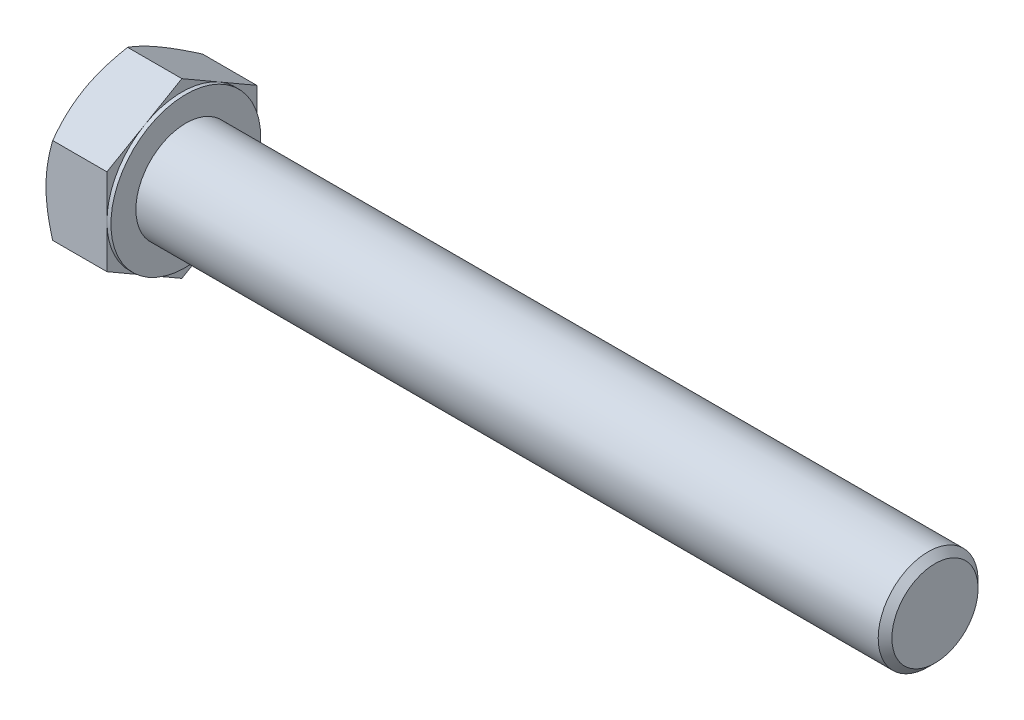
ISO-10303-21;
HEADER;
FILE_DESCRIPTION(('STEP AP214'),'2;1');
FILE_NAME('part.step','',(''),(''),'','','');
FILE_SCHEMA(('AUTOMOTIVE_DESIGN { 1 0 10303 214 1 1 1 1 }'));
ENDSEC;
DATA;
#1=APPLICATION_CONTEXT('core data for automotive mechanical design processes');
#2=APPLICATION_PROTOCOL_DEFINITION('international standard','automotive_design',2000,#1);
#3=PRODUCT_CONTEXT('',#1,'mechanical');
#4=PRODUCT('Part','Part','',(#3));
#5=PRODUCT_RELATED_PRODUCT_CATEGORY('part','',(#4));
#6=PRODUCT_DEFINITION_FORMATION('','',#4);
#7=PRODUCT_DEFINITION_CONTEXT('part definition',#1,'design');
#8=PRODUCT_DEFINITION('design','',#6,#7);
#9=PRODUCT_DEFINITION_SHAPE('','',#8);
#10=(LENGTH_UNIT() NAMED_UNIT(*) SI_UNIT(.MILLI.,.METRE.));
#11=(NAMED_UNIT(*) PLANE_ANGLE_UNIT() SI_UNIT($,.RADIAN.));
#12=(NAMED_UNIT(*) SI_UNIT($,.STERADIAN.) SOLID_ANGLE_UNIT());
#13=UNCERTAINTY_MEASURE_WITH_UNIT(LENGTH_MEASURE(1.E-05),#10,'distance_accuracy_value','');
#14=(GEOMETRIC_REPRESENTATION_CONTEXT(3) GLOBAL_UNCERTAINTY_ASSIGNED_CONTEXT((#13)) GLOBAL_UNIT_ASSIGNED_CONTEXT((#10,
#11,#12)) REPRESENTATION_CONTEXT('',''));
#15=CARTESIAN_POINT('',(0.,0.,0.));
#16=DIRECTION('',(0.,0.,1.));
#17=DIRECTION('',(1.,0.,0.));
#18=AXIS2_PLACEMENT_3D('',#15,#16,#17);
#19=CARTESIAN_POINT('',(13.,17.3205080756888,0.));
#20=DIRECTION('',(1.,0.,0.));
#21=DIRECTION('',(0.,0.,-1.));
#22=AXIS2_PLACEMENT_3D('',#19,#20,#21);
#23=PLANE('',#22);
#24=CARTESIAN_POINT('',(13.,0.,0.));
#25=DIRECTION('',(1.,0.,0.));
#26=DIRECTION('',(0.,0.,-1.));
#27=AXIS2_PLACEMENT_3D('',#24,#25,#26);
#28=CIRCLE('',#27,10.);
#29=CARTESIAN_POINT('',(13.,0.,-10.));
#30=VERTEX_POINT('',#29);
#31=EDGE_CURVE('E269',#30,#30,#28,.F.);
#32=ORIENTED_EDGE('',*,*,#31,.T.);
#33=EDGE_LOOP('',(#32));
#34=FACE_BOUND('',#33,.T.);
#35=CARTESIAN_POINT('',(13.,0.,0.));
#36=DIRECTION('',(1.,0.,0.));
#37=DIRECTION('',(0.,0.,-1.));
#38=AXIS2_PLACEMENT_3D('',#35,#36,#37);
#39=CIRCLE('',#38,15.);
#40=CARTESIAN_POINT('',(13.,0.,-15.));
#41=VERTEX_POINT('',#40);
#42=EDGE_CURVE('E327',#41,#41,#39,.T.);
#43=ORIENTED_EDGE('',*,*,#42,.T.);
#44=EDGE_LOOP('',(#43));
#45=FACE_BOUND('',#44,.T.);
#46=ADVANCED_FACE('F33',(#34,#45),#23,.T.);
#47=CARTESIAN_POINT('',(0.,0.,0.));
#48=DIRECTION('',(-1.,0.,0.));
#49=DIRECTION('',(0.,0.,1.));
#50=AXIS2_PLACEMENT_3D('',#47,#48,#49);
#51=CYLINDRICAL_SURFACE('',#50,10.);
#52=ORIENTED_EDGE('',*,*,#31,.F.);
#53=EDGE_LOOP('',(#52));
#54=FACE_BOUND('',#53,.T.);
#55=CARTESIAN_POINT('',(161.626,0.,0.));
#56=DIRECTION('',(-1.,0.,0.));
#57=DIRECTION('',(0.,0.,1.));
#58=AXIS2_PLACEMENT_3D('',#55,#56,#57);
#59=CIRCLE('',#58,10.);
#60=CARTESIAN_POINT('',(161.626,0.,10.));
#61=VERTEX_POINT('',#60);
#62=EDGE_CURVE('E267',#61,#61,#59,.T.);
#63=ORIENTED_EDGE('',*,*,#62,.T.);
#64=EDGE_LOOP('',(#63));
#65=FACE_BOUND('',#64,.T.);
#66=ADVANCED_FACE('F242',(#54,#65),#51,.T.);
#67=CARTESIAN_POINT('',(163.,0.,0.));
#68=DIRECTION('',(-1.,0.,0.));
#69=DIRECTION('',(0.,0.,1.));
#70=AXIS2_PLACEMENT_3D('',#67,#68,#69);
#71=CONICAL_SURFACE('',#70,8.626,0.785398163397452);
#72=ORIENTED_EDGE('',*,*,#62,.F.);
#73=EDGE_LOOP('',(#72));
#74=FACE_BOUND('',#73,.T.);
#75=CARTESIAN_POINT('',(163.,0.,0.));
#76=DIRECTION('',(-1.,0.,0.));
#77=DIRECTION('',(0.,0.,1.));
#78=AXIS2_PLACEMENT_3D('',#75,#76,#77);
#79=CIRCLE('',#78,8.626);
#80=CARTESIAN_POINT('',(163.,0.,8.626));
#81=VERTEX_POINT('',#80);
#82=EDGE_CURVE('E229',#81,#81,#79,.T.);
#83=ORIENTED_EDGE('',*,*,#82,.T.);
#84=EDGE_LOOP('',(#83));
#85=FACE_BOUND('',#84,.T.);
#86=ADVANCED_FACE('F247',(#74,#85),#71,.T.);
#87=CARTESIAN_POINT('',(163.,0.,0.));
#88=DIRECTION('',(-1.,0.,0.));
#89=DIRECTION('',(0.,0.,1.));
#90=AXIS2_PLACEMENT_3D('',#87,#88,#89);
#91=PLANE('',#90);
#92=ORIENTED_EDGE('',*,*,#82,.F.);
#93=EDGE_LOOP('',(#92));
#94=FACE_BOUND('',#93,.T.);
#95=ADVANCED_FACE('F254',(#94),#91,.F.);
#96=CARTESIAN_POINT('',(12.2,15.,0.));
#97=DIRECTION('',(1.,0.,0.));
#98=DIRECTION('',(0.,0.,-1.));
#99=AXIS2_PLACEMENT_3D('',#96,#97,#98);
#100=PLANE('',#99);
#101=DIRECTION('',(0.,0.500000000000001,0.866025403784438));
#102=VECTOR('',#101,1.);
#103=CARTESIAN_POINT('',(12.2,8.66025403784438,-15.));
#104=LINE('',#103,#102);
#105=CARTESIAN_POINT('',(12.2,8.66025403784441,-15.));
#106=VERTEX_POINT('',#105);
#107=CARTESIAN_POINT('',(12.2,12.9903810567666,-7.50000000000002));
#108=VERTEX_POINT('',#107);
#109=EDGE_CURVE('E166',#106,#108,#104,.T.);
#110=ORIENTED_EDGE('',*,*,#109,.T.);
#111=CARTESIAN_POINT('',(12.2,0.,0.));
#112=DIRECTION('',(-1.,0.,0.));
#113=DIRECTION('',(0.,0.,1.));
#114=AXIS2_PLACEMENT_3D('',#111,#112,#113);
#115=CIRCLE('',#114,15.);
#116=CARTESIAN_POINT('',(12.2,0.,-15.));
#117=VERTEX_POINT('',#116);
#118=EDGE_CURVE('E49',#108,#117,#115,.T.);
#119=ORIENTED_EDGE('',*,*,#118,.T.);
#120=DIRECTION('',(0.,1.,0.));
#121=VECTOR('',#120,1.);
#122=CARTESIAN_POINT('',(12.2,8.66025403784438,-15.));
#123=LINE('',#122,#121);
#124=EDGE_CURVE('E38',#117,#106,#123,.T.);
#125=ORIENTED_EDGE('',*,*,#124,.T.);
#126=EDGE_LOOP('',(#110,#119,#125));
#127=FACE_BOUND('',#126,.T.);
#128=ADVANCED_FACE('F257',(#127),#100,.T.);
#129=CARTESIAN_POINT('',(12.2,17.3205080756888,0.));
#130=VERTEX_POINT('',#129);
#131=EDGE_CURVE('E164',#108,#130,#104,.T.);
#132=ORIENTED_EDGE('',*,*,#131,.T.);
#133=DIRECTION('',(0.,-0.500000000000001,0.866025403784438));
#134=VECTOR('',#133,1.);
#135=CARTESIAN_POINT('',(12.2,17.3205080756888,0.));
#136=LINE('',#135,#134);
#137=CARTESIAN_POINT('',(12.2,12.9903810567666,7.50000000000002));
#138=VERTEX_POINT('',#137);
#139=EDGE_CURVE('E163',#130,#138,#136,.T.);
#140=ORIENTED_EDGE('',*,*,#139,.T.);
#141=EDGE_CURVE('E152',#138,#108,#115,.T.);
#142=ORIENTED_EDGE('',*,*,#141,.T.);
#143=EDGE_LOOP('',(#132,#140,#142));
#144=FACE_BOUND('',#143,.T.);
#145=ADVANCED_FACE('F262',(#144),#100,.T.);
#146=CARTESIAN_POINT('',(12.2,8.66025403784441,15.));
#147=VERTEX_POINT('',#146);
#148=EDGE_CURVE('E131',#138,#147,#136,.T.);
#149=ORIENTED_EDGE('',*,*,#148,.T.);
#150=DIRECTION('',(0.,-1.,0.));
#151=VECTOR('',#150,1.);
#152=CARTESIAN_POINT('',(12.2,8.66025403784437,15.));
#153=LINE('',#152,#151);
#154=CARTESIAN_POINT('',(12.2,0.,15.));
#155=VERTEX_POINT('',#154);
#156=EDGE_CURVE('E125',#147,#155,#153,.T.);
#157=ORIENTED_EDGE('',*,*,#156,.T.);
#158=EDGE_CURVE('E129',#155,#138,#115,.T.);
#159=ORIENTED_EDGE('',*,*,#158,.T.);
#160=EDGE_LOOP('',(#149,#157,#159));
#161=FACE_BOUND('',#160,.T.);
#162=ADVANCED_FACE('F127',(#161),#100,.T.);
#163=CARTESIAN_POINT('',(12.2,-8.6602540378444,15.));
#164=VERTEX_POINT('',#163);
#165=EDGE_CURVE('E135',#155,#164,#153,.T.);
#166=ORIENTED_EDGE('',*,*,#165,.T.);
#167=DIRECTION('',(0.,-0.500000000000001,-0.866025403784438));
#168=VECTOR('',#167,1.);
#169=CARTESIAN_POINT('',(12.2,-17.3205080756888,0.));
#170=LINE('',#169,#168);
#171=CARTESIAN_POINT('',(12.2,-12.9903810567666,7.50000000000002));
#172=VERTEX_POINT('',#171);
#173=EDGE_CURVE('E142',#164,#172,#170,.T.);
#174=ORIENTED_EDGE('',*,*,#173,.T.);
#175=EDGE_CURVE('E139',#172,#155,#115,.T.);
#176=ORIENTED_EDGE('',*,*,#175,.T.);
#177=EDGE_LOOP('',(#166,#174,#176));
#178=FACE_BOUND('',#177,.T.);
#179=ADVANCED_FACE('F140',(#178),#100,.T.);
#180=CARTESIAN_POINT('',(12.2,-17.3205080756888,0.));
#181=VERTEX_POINT('',#180);
#182=EDGE_CURVE('E158',#172,#181,#170,.T.);
#183=ORIENTED_EDGE('',*,*,#182,.T.);
#184=DIRECTION('',(0.,0.5,-0.866025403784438));
#185=VECTOR('',#184,1.);
#186=CARTESIAN_POINT('',(12.2,-8.66025403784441,-15.));
#187=LINE('',#186,#185);
#188=CARTESIAN_POINT('',(12.2,-12.9903810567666,-7.50000000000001));
#189=VERTEX_POINT('',#188);
#190=EDGE_CURVE('E340',#181,#189,#187,.T.);
#191=ORIENTED_EDGE('',*,*,#190,.T.);
#192=EDGE_CURVE('E146',#189,#172,#115,.T.);
#193=ORIENTED_EDGE('',*,*,#192,.T.);
#194=EDGE_LOOP('',(#183,#191,#193));
#195=FACE_BOUND('',#194,.T.);
#196=ADVANCED_FACE('F342',(#195),#100,.T.);
#197=CARTESIAN_POINT('',(12.2,-8.6602540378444,-15.));
#198=VERTEX_POINT('',#197);
#199=EDGE_CURVE('E153',#189,#198,#187,.T.);
#200=ORIENTED_EDGE('',*,*,#199,.T.);
#201=EDGE_CURVE('E11',#198,#117,#123,.T.);
#202=ORIENTED_EDGE('',*,*,#201,.T.);
#203=EDGE_CURVE('E339',#117,#189,#115,.T.);
#204=ORIENTED_EDGE('',*,*,#203,.T.);
#205=EDGE_LOOP('',(#200,#202,#204));
#206=FACE_BOUND('',#205,.T.);
#207=ADVANCED_FACE('F263',(#206),#100,.T.);
#208=CARTESIAN_POINT('',(0.,0.,0.));
#209=DIRECTION('',(-1.,0.,0.));
#210=DIRECTION('',(0.,0.,1.));
#211=AXIS2_PLACEMENT_3D('',#208,#209,#210);
#212=CYLINDRICAL_SURFACE('',#211,15.);
#213=ORIENTED_EDGE('',*,*,#118,.F.);
#214=ORIENTED_EDGE('',*,*,#141,.F.);
#215=ORIENTED_EDGE('',*,*,#158,.F.);
#216=ORIENTED_EDGE('',*,*,#175,.F.);
#217=ORIENTED_EDGE('',*,*,#192,.F.);
#218=ORIENTED_EDGE('',*,*,#203,.F.);
#219=EDGE_LOOP('',(#213,#214,#215,#216,#217,#218));
#220=FACE_BOUND('',#219,.T.);
#221=ORIENTED_EDGE('',*,*,#42,.F.);
#222=EDGE_LOOP('',(#221));
#223=FACE_BOUND('',#222,.T.);
#224=ADVANCED_FACE('F149',(#220,#223),#212,.T.);
#225=CARTESIAN_POINT('',(0.,17.3205080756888,0.));
#226=DIRECTION('',(1.,0.,0.));
#227=DIRECTION('',(0.,0.,-1.));
#228=AXIS2_PLACEMENT_3D('',#225,#226,#227);
#229=PLANE('',#228);
#230=CARTESIAN_POINT('',(0.,0.,0.));
#231=DIRECTION('',(1.,0.,0.));
#232=DIRECTION('',(0.,0.,-1.));
#233=AXIS2_PLACEMENT_3D('',#230,#231,#232);
#234=CIRCLE('',#233,15.);
#235=CARTESIAN_POINT('',(0.,0.,-15.));
#236=VERTEX_POINT('',#235);
#237=CARTESIAN_POINT('',(0.,12.9903810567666,-7.50000000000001));
#238=VERTEX_POINT('',#237);
#239=EDGE_CURVE('E326',#236,#238,#234,.T.);
#240=ORIENTED_EDGE('',*,*,#239,.F.);
#241=CARTESIAN_POINT('',(0.,-12.9903810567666,-7.50000000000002));
#242=VERTEX_POINT('',#241);
#243=EDGE_CURVE('E325',#242,#236,#234,.T.);
#244=ORIENTED_EDGE('',*,*,#243,.F.);
#245=CARTESIAN_POINT('',(0.,-12.9903810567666,7.50000000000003));
#246=VERTEX_POINT('',#245);
#247=EDGE_CURVE('E287',#246,#242,#234,.T.);
#248=ORIENTED_EDGE('',*,*,#247,.F.);
#249=CARTESIAN_POINT('',(0.,0.,15.));
#250=VERTEX_POINT('',#249);
#251=EDGE_CURVE('E297',#250,#246,#234,.T.);
#252=ORIENTED_EDGE('',*,*,#251,.F.);
#253=CARTESIAN_POINT('',(0.,12.9903810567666,7.50000000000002));
#254=VERTEX_POINT('',#253);
#255=EDGE_CURVE('E305',#254,#250,#234,.T.);
#256=ORIENTED_EDGE('',*,*,#255,.F.);
#257=EDGE_CURVE('E310',#238,#254,#234,.T.);
#258=ORIENTED_EDGE('',*,*,#257,.F.);
#259=EDGE_LOOP('',(#240,#244,#248,#252,#256,#258));
#260=FACE_BOUND('',#259,.T.);
#261=ADVANCED_FACE('F193',(#260),#229,.F.);
#262=CARTESIAN_POINT('',(-3.75000000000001,0.,0.));
#263=DIRECTION('',(1.,0.,0.));
#264=DIRECTION('',(0.,0.,-1.));
#265=AXIS2_PLACEMENT_3D('',#262,#263,#264);
#266=CONICAL_SURFACE('',#265,8.5048094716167,1.0471975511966);
#267=CARTESIAN_POINT('',(1.33981262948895,17.3206235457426,0.0002));
#268=CARTESIAN_POINT('',(1.22992178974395,17.130274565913,-0.329494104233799));
#269=CARTESIAN_POINT('',(1.12501758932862,16.939183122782,-0.660474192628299));
#270=CARTESIAN_POINT('',(0.926568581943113,16.5554679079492,-1.32508844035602));
#271=CARTESIAN_POINT('',(0.833027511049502,16.3628436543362,-1.6587234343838));
#272=CARTESIAN_POINT('',(0.658562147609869,15.9756905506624,-2.32929228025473));
#273=CARTESIAN_POINT('',(0.577667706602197,15.7811583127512,-2.66623200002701));
#274=CARTESIAN_POINT('',(0.430232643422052,15.3907420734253,-3.34245276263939));
#275=CARTESIAN_POINT('',(0.363691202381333,15.1948581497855,-3.68173367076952));
#276=CARTESIAN_POINT('',(0.247792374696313,14.8067578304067,-4.35394314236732));
#277=CARTESIAN_POINT('',(0.19805138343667,14.6145702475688,-4.68682180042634));
#278=CARTESIAN_POINT('',(0.11464674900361,14.2293144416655,-5.3541044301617));
#279=CARTESIAN_POINT('',(0.0809834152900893,14.0362462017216,-5.6885084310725));
#280=CARTESIAN_POINT('',(0.0305840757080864,13.6497853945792,-6.35787818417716));
#281=CARTESIAN_POINT('',(0.0138279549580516,13.4563934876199,-6.69284279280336));
#282=CARTESIAN_POINT('',(-0.00239660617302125,13.0694311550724,-7.36308121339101));
#283=CARTESIAN_POINT('',(-0.00186558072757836,12.8758607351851,-7.69835501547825));
#284=CARTESIAN_POINT('',(0.0152766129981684,12.5139822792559,-8.32514688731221));
#285=CARTESIAN_POINT('',(0.029796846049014,12.3456484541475,-8.61670962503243));
#286=CARTESIAN_POINT('',(0.0716371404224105,12.0093680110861,-9.19916443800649));
#287=CARTESIAN_POINT('',(0.0989581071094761,11.8414214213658,-9.49005646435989));
#288=CARTESIAN_POINT('',(0.165923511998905,11.5060066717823,-10.0710118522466));
#289=CARTESIAN_POINT('',(0.205578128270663,11.338539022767,-10.3610743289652));
#290=CARTESIAN_POINT('',(0.296515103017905,11.0043888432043,-10.939839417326));
#291=CARTESIAN_POINT('',(0.347798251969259,10.8377063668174,-11.2285419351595));
#292=CARTESIAN_POINT('',(0.520386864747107,10.3317324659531,-12.1049144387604));
#293=CARTESIAN_POINT('',(0.658901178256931,9.99390625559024,-12.6900465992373));
#294=CARTESIAN_POINT('',(0.973271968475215,9.32329122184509,-13.8515859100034));
#295=CARTESIAN_POINT('',(1.14905461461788,8.99049381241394,-14.4280079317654));
#296=CARTESIAN_POINT('',(1.33981262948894,8.66013856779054,-15.0002));
#297=B_SPLINE_CURVE_WITH_KNOTS('',3,(#267,#268,#269,#270,#271,#272,#273,#274,#275,#276,#277,
#278,#279,#280,#281,#282,#283,#284,#285,#286,#287,#288,#289,#290,#291,#292,#293,#294,#295,#296),
.UNSPECIFIED.,.F.,.F.,(4,2,2,2,2,2,2,2,2,2,2,2,2,2,4),(0.,1.18875411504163,2.37789802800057,
3.56980778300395,4.76164951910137,5.92407379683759,7.08652044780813,8.24758247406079,
9.40860862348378,10.4193068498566,11.4300765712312,12.4416826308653,13.4533574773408,
15.5211962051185,17.5849760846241),.UNSPECIFIED.);
#298=CARTESIAN_POINT('',(1.33974596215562,17.3205080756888,0.));
#299=VERTEX_POINT('',#298);
#300=EDGE_CURVE('E57',#299,#238,#297,.T.);
#301=ORIENTED_EDGE('',*,*,#300,.T.);
#302=ORIENTED_EDGE('',*,*,#257,.T.);
#303=CARTESIAN_POINT('',(1.33981262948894,8.66013856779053,15.0002));
#304=CARTESIAN_POINT('',(1.22992178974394,8.85048754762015,14.6705058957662));
#305=CARTESIAN_POINT('',(1.12501758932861,9.04157899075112,14.3395258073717));
#306=CARTESIAN_POINT('',(0.926568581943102,9.42529420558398,13.674911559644));
#307=CARTESIAN_POINT('',(0.833027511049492,9.617918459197,13.3412765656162));
#308=CARTESIAN_POINT('',(0.658562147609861,10.0050715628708,12.6707077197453));
#309=CARTESIAN_POINT('',(0.577667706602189,10.199603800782,12.333767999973));
#310=CARTESIAN_POINT('',(0.430232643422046,10.5900200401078,11.6575472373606));
#311=CARTESIAN_POINT('',(0.363691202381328,10.7859039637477,11.3182663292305));
#312=CARTESIAN_POINT('',(0.247792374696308,11.1740042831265,10.6460568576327));
#313=CARTESIAN_POINT('',(0.198051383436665,11.3661918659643,10.3131781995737));
#314=CARTESIAN_POINT('',(0.114646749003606,11.7514476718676,9.6458955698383));
#315=CARTESIAN_POINT('',(0.0809834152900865,11.9445159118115,9.31149156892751));
#316=CARTESIAN_POINT('',(0.0305840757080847,12.3309767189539,8.64212181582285));
#317=CARTESIAN_POINT('',(0.0138279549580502,12.5243686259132,8.30715720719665));
#318=CARTESIAN_POINT('',(-0.00239660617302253,12.9113309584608,7.636918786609));
#319=CARTESIAN_POINT('',(-0.00186558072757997,13.1049013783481,7.30164498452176));
#320=CARTESIAN_POINT('',(0.0152766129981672,13.4667798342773,6.6748531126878));
#321=CARTESIAN_POINT('',(0.0297968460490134,13.6351136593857,6.38329037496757));
#322=CARTESIAN_POINT('',(0.0716371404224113,13.9713941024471,5.80083556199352));
#323=CARTESIAN_POINT('',(0.0989581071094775,14.1393406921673,5.50994353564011));
#324=CARTESIAN_POINT('',(0.165923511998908,14.4747554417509,4.92898814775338));
#325=CARTESIAN_POINT('',(0.205578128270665,14.6422230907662,4.63892567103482));
#326=CARTESIAN_POINT('',(0.296515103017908,14.9763732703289,4.06016058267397));
#327=CARTESIAN_POINT('',(0.347798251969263,15.1430557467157,3.77145806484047));
#328=CARTESIAN_POINT('',(0.520386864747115,15.6490296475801,2.89508556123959));
#329=CARTESIAN_POINT('',(0.658901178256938,15.9868558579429,2.30995340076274));
#330=CARTESIAN_POINT('',(0.973271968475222,16.6574708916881,1.14841408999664));
#331=CARTESIAN_POINT('',(1.14905461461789,16.9902683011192,0.571992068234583));
#332=CARTESIAN_POINT('',(1.33981262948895,17.3206235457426,-0.00020000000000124));
#333=B_SPLINE_CURVE_WITH_KNOTS('',3,(#303,#304,#305,#306,#307,#308,#309,#310,#311,#312,#313,
#314,#315,#316,#317,#318,#319,#320,#321,#322,#323,#324,#325,#326,#327,#328,#329,#330,#331,#332),
.UNSPECIFIED.,.F.,.F.,(4,2,2,2,2,2,2,2,2,2,2,2,2,2,4),(0.,1.18875411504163,2.37789802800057,
3.56980778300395,4.76164951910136,5.92407379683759,7.08652044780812,8.24758247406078,
9.40860862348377,10.4193068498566,11.4300765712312,12.4416826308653,13.4533574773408,
15.5211962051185,17.5849760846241),.UNSPECIFIED.);
#334=EDGE_CURVE('E228',#254,#299,#333,.T.);
#335=ORIENTED_EDGE('',*,*,#334,.T.);
#336=EDGE_LOOP('',(#301,#302,#335));
#337=FACE_BOUND('',#336,.T.);
#338=ADVANCED_FACE('F182',(#337),#266,.T.);
#339=CARTESIAN_POINT('',(1.33974596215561,8.66025403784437,15.));
#340=VERTEX_POINT('',#339);
#341=EDGE_CURVE('E223',#340,#254,#333,.T.);
#342=ORIENTED_EDGE('',*,*,#341,.T.);
#343=ORIENTED_EDGE('',*,*,#255,.T.);
#344=CARTESIAN_POINT('',(7.34067071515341,-23.3042652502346,15.));
#345=CARTESIAN_POINT('',(7.18156779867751,-22.9765341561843,15.));
#346=CARTESIAN_POINT('',(7.02325509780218,-22.648419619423,15.));
#347=CARTESIAN_POINT('',(6.70838900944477,-21.9913436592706,15.));
#348=CARTESIAN_POINT('',(6.55183563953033,-21.6623822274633,15.));
#349=CARTESIAN_POINT('',(6.08504186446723,-20.6740205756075,15.));
#350=CARTESIAN_POINT('',(5.77771466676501,-20.013239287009,15.));
#351=CARTESIAN_POINT('',(5.1710334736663,-18.6836927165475,15.));
#352=CARTESIAN_POINT('',(4.87173163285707,-18.0149035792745,15.));
#353=CARTESIAN_POINT('',(4.28531537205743,-16.672021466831,15.));
#354=CARTESIAN_POINT('',(3.99820037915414,-15.997928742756,15.));
#355=CARTESIAN_POINT('',(3.43032614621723,-14.6214178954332,15.));
#356=CARTESIAN_POINT('',(3.1500739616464,-13.9187894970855,15.));
#357=CARTESIAN_POINT('',(2.61067811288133,-12.5053227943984,15.));
#358=CARTESIAN_POINT('',(2.35153681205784,-11.7944835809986,15.));
#359=CARTESIAN_POINT('',(1.86113921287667,-10.3648046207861,15.));
#360=CARTESIAN_POINT('',(1.62982681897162,-9.64598427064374,15.));
#361=CARTESIAN_POINT('',(1.2024688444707,-8.1979641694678,15.));
#362=CARTESIAN_POINT('',(1.00641219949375,-7.4687677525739,15.));
#363=CARTESIAN_POINT('',(0.746381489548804,-6.36908708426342,15.));
#364=CARTESIAN_POINT('',(0.665556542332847,-6.00256349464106,15.));
#365=CARTESIAN_POINT('',(0.516215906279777,-5.26700410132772,15.));
#366=CARTESIAN_POINT('',(0.447699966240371,-4.89796834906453,15.));
#367=CARTESIAN_POINT('',(0.324184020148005,-4.15763498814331,15.));
#368=CARTESIAN_POINT('',(0.269183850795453,-3.78633740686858,15.));
#369=CARTESIAN_POINT('',(0.173795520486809,-3.04187310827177,15.));
#370=CARTESIAN_POINT('',(0.133406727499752,-2.66870647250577,15.));
#371=CARTESIAN_POINT('',(0.0685517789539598,-1.92591313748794,15.));
#372=CARTESIAN_POINT('',(0.0438838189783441,-1.55630416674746,15.));
#373=CARTESIAN_POINT('',(0.0102026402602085,-0.816374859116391,15.));
#374=CARTESIAN_POINT('',(0.00118916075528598,-0.446054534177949,15.));
#375=CARTESIAN_POINT('',(-0.000968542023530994,0.294636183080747,15.));
#376=CARTESIAN_POINT('',(0.00588729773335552,0.66500657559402,15.));
#377=CARTESIAN_POINT('',(0.0353005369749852,1.40512739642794,15.));
#378=CARTESIAN_POINT('',(0.0578586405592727,1.7748777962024,15.));
#379=CARTESIAN_POINT('',(0.130359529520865,2.66225131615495,15.));
#380=CARTESIAN_POINT('',(0.187682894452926,3.17928211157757,15.));
#381=CARTESIAN_POINT('',(0.329920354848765,4.20953694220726,15.));
#382=CARTESIAN_POINT('',(0.41483816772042,4.72276045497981,15.));
#383=CARTESIAN_POINT('',(0.609243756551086,5.74490151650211,15.));
#384=CARTESIAN_POINT('',(0.718750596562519,6.25381540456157,15.));
#385=CARTESIAN_POINT('',(0.958990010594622,7.26655289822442,15.));
#386=CARTESIAN_POINT('',(1.08972227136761,7.77037657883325,15.));
#387=CARTESIAN_POINT('',(1.37231868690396,8.78401362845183,15.));
#388=CARTESIAN_POINT('',(1.52458533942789,9.29371400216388,15.));
#389=CARTESIAN_POINT('',(1.84492743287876,10.3080942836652,15.));
#390=CARTESIAN_POINT('',(2.01300297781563,10.8127741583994,15.));
#391=CARTESIAN_POINT('',(2.36228753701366,11.8173612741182,15.));
#392=CARTESIAN_POINT('',(2.54349222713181,12.3172700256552,15.));
#393=CARTESIAN_POINT('',(2.91689581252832,13.3129403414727,15.));
#394=CARTESIAN_POINT('',(3.10909458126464,13.8087019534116,15.));
#395=CARTESIAN_POINT('',(3.57360485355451,14.9746038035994,15.));
#396=CARTESIAN_POINT('',(3.84982124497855,15.6431858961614,15.));
#397=CARTESIAN_POINT('',(4.41563784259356,16.9746795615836,15.));
#398=CARTESIAN_POINT('',(4.70523886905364,17.6375907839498,15.));
#399=CARTESIAN_POINT('',(5.29515643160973,18.9587926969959,15.));
#400=CARTESIAN_POINT('',(5.59547534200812,19.6170823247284,15.));
#401=CARTESIAN_POINT('',(6.20467573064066,20.929660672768,15.));
#402=CARTESIAN_POINT('',(6.51355702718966,21.5839494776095,15.));
#403=CARTESIAN_POINT('',(7.13862847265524,22.8898994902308,15.));
#404=CARTESIAN_POINT('',(7.45482623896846,23.5415570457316,15.));
#405=CARTESIAN_POINT('',(8.09295875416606,24.8420565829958,15.));
#406=CARTESIAN_POINT('',(8.4148935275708,25.4908985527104,15.));
#407=CARTESIAN_POINT('',(9.06347819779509,26.7861146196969,15.));
#408=CARTESIAN_POINT('',(9.39012748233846,27.4324890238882,15.));
#409=CARTESIAN_POINT('',(10.0474129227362,28.723208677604,15.));
#410=CARTESIAN_POINT('',(10.3780490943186,29.367553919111,15.));
#411=CARTESIAN_POINT('',(11.3194716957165,31.1905009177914,15.));
#412=CARTESIAN_POINT('',(11.9342118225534,32.3670608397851,15.));
#413=CARTESIAN_POINT('',(13.1721121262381,34.7157851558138,15.));
#414=CARTESIAN_POINT('',(13.7952725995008,35.8879493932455,15.));
#415=CARTESIAN_POINT('',(15.0464839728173,38.2259091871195,15.));
#416=CARTESIAN_POINT('',(15.6745188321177,39.3917133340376,15.));
#417=CARTESIAN_POINT('',(16.6203232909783,41.1383439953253,15.));
#418=CARTESIAN_POINT('',(16.9362082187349,41.7201925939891,15.));
#419=CARTESIAN_POINT('',(17.5691038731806,42.8832760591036,15.));
#420=CARTESIAN_POINT('',(17.886114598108,43.4645109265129,15.));
#421=CARTESIAN_POINT('',(18.2036234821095,44.045473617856,15.));
#422=B_SPLINE_CURVE_WITH_KNOTS('',3,(#344,#345,#346,#347,#348,#349,#350,#351,#352,#353,#354,
#355,#356,#357,#358,#359,#360,#361,#362,#363,#364,#365,#366,#367,#368,#369,#370,#371,#372,#373,
#374,#375,#376,#377,#378,#379,#380,#381,#382,#383,#384,#385,#386,#387,#388,#389,#390,#391,#392,
#393,#394,#395,#396,#397,#398,#399,#400,#401,#402,#403,#404,#405,#406,#407,#408,#409,#410,#411,
#412,#413,#414,#415,#416,#417,#418,#419,#420,#421),.UNSPECIFIED.,.F.,.F.,(4,2,2,2,2,2,2,2,2,2,2,
2,2,2,2,2,2,2,2,2,2,2,2,2,2,2,2,2,2,2,2,2,2,2,2,2,2,2,4),(0.,1.0929265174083,2.18586393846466,
4.37206003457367,6.57008822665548,8.76801297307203,11.037126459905,13.3064936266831,
15.5712068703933,17.8352081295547,18.9610232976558,20.0868154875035,21.2125940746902,
22.3383239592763,23.4492954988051,24.5602485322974,25.6712059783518,26.7822132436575,
28.3419475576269,29.9018920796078,31.4630502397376,33.0241853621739,34.6197538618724,
36.2153328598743,37.8103887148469,39.4054262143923,41.5754079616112,43.7455228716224,
45.9161215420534,48.0866741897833,50.2595985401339,52.4325321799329,54.6051861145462,
56.7778486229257,60.7602319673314,64.7427558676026,68.715363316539,70.7015596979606,
72.6877529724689),.UNSPECIFIED.);
#423=EDGE_CURVE('E222',#250,#340,#422,.T.);
#424=ORIENTED_EDGE('',*,*,#423,.T.);
#425=EDGE_LOOP('',(#342,#343,#424));
#426=FACE_BOUND('',#425,.T.);
#427=ADVANCED_FACE('F303',(#426),#266,.T.);
#428=CARTESIAN_POINT('',(1.33974596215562,-8.6602540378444,15.));
#429=VERTEX_POINT('',#428);
#430=EDGE_CURVE('E217',#429,#250,#422,.T.);
#431=ORIENTED_EDGE('',*,*,#430,.T.);
#432=ORIENTED_EDGE('',*,*,#251,.T.);
#433=CARTESIAN_POINT('',(1.33981262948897,-17.3206235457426,-0.000200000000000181));
#434=CARTESIAN_POINT('',(1.22992178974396,-17.130274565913,0.3294941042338));
#435=CARTESIAN_POINT('',(1.12501758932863,-16.9391831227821,0.660474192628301));
#436=CARTESIAN_POINT('',(0.926568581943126,-16.5554679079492,1.32508844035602));
#437=CARTESIAN_POINT('',(0.833027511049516,-16.3628436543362,1.65872343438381));
#438=CARTESIAN_POINT('',(0.658562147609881,-15.9756905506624,2.32929228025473));
#439=CARTESIAN_POINT('',(0.577667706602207,-15.7811583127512,2.66623200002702));
#440=CARTESIAN_POINT('',(0.430232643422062,-15.3907420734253,3.34245276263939));
#441=CARTESIAN_POINT('',(0.363691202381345,-15.1948581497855,3.68173367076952));
#442=CARTESIAN_POINT('',(0.247792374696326,-14.8067578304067,4.35394314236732));
#443=CARTESIAN_POINT('',(0.198051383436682,-14.6145702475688,4.68682180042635));
#444=CARTESIAN_POINT('',(0.114646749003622,-14.2293144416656,5.3541044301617));
#445=CARTESIAN_POINT('',(0.0809834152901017,-14.0362462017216,5.6885084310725));
#446=CARTESIAN_POINT('',(0.0305840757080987,-13.6497853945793,6.35787818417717));
#447=CARTESIAN_POINT('',(0.0138279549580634,-13.4563934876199,6.69284279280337));
#448=CARTESIAN_POINT('',(-0.00239660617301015,-13.0694311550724,7.36308121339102));
#449=CARTESIAN_POINT('',(-0.00186558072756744,-12.8758607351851,7.69835501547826));
#450=CARTESIAN_POINT('',(0.0152766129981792,-12.5139822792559,8.32514688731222));
#451=CARTESIAN_POINT('',(0.0297968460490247,-12.3456484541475,8.61670962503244));
#452=CARTESIAN_POINT('',(0.0716371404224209,-12.0093680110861,9.19916443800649));
#453=CARTESIAN_POINT('',(0.0989581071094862,-11.8414214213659,9.4900564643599));
#454=CARTESIAN_POINT('',(0.165923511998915,-11.5060066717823,10.0710118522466));
#455=CARTESIAN_POINT('',(0.205578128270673,-11.338539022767,10.3610743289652));
#456=CARTESIAN_POINT('',(0.296515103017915,-11.0043888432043,10.939839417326));
#457=CARTESIAN_POINT('',(0.347798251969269,-10.8377063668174,11.2285419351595));
#458=CARTESIAN_POINT('',(0.520386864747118,-10.3317324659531,12.1049144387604));
#459=CARTESIAN_POINT('',(0.65890117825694,-9.99390625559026,12.6900465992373));
#460=CARTESIAN_POINT('',(0.973271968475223,-9.32329122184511,13.8515859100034));
#461=CARTESIAN_POINT('',(1.14905461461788,-8.99049381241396,14.4280079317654));
#462=CARTESIAN_POINT('',(1.33981262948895,-8.66013856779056,15.0002));
#463=B_SPLINE_CURVE_WITH_KNOTS('',3,(#433,#434,#435,#436,#437,#438,#439,#440,#441,#442,#443,
#444,#445,#446,#447,#448,#449,#450,#451,#452,#453,#454,#455,#456,#457,#458,#459,#460,#461,#462),
.UNSPECIFIED.,.F.,.F.,(4,2,2,2,2,2,2,2,2,2,2,2,2,2,4),(0.,1.18875411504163,2.37789802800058,
3.56980778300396,4.76164951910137,5.9240737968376,7.08652044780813,8.2475824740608,
9.40860862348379,10.4193068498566,11.4300765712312,12.4416826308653,13.4533574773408,
15.5211962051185,17.5849760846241),.UNSPECIFIED.);
#464=EDGE_CURVE('E211',#246,#429,#463,.T.);
#465=ORIENTED_EDGE('',*,*,#464,.T.);
#466=EDGE_LOOP('',(#431,#432,#465));
#467=FACE_BOUND('',#466,.T.);
#468=ADVANCED_FACE('F294',(#467),#266,.T.);
#469=CARTESIAN_POINT('',(1.33974596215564,-17.3205080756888,0.));
#470=VERTEX_POINT('',#469);
#471=EDGE_CURVE('E206',#470,#246,#463,.T.);
#472=ORIENTED_EDGE('',*,*,#471,.T.);
#473=ORIENTED_EDGE('',*,*,#247,.T.);
#474=CARTESIAN_POINT('',(1.33981262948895,-8.66013856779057,-15.0002));
#475=CARTESIAN_POINT('',(1.22992178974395,-8.85048754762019,-14.6705058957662));
#476=CARTESIAN_POINT('',(1.12501758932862,-9.04157899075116,-14.3395258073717));
#477=CARTESIAN_POINT('',(0.926568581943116,-9.42529420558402,-13.674911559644));
#478=CARTESIAN_POINT('',(0.833027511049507,-9.61791845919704,-13.3412765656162));
#479=CARTESIAN_POINT('',(0.658562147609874,-10.0050715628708,-12.6707077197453));
#480=CARTESIAN_POINT('',(0.577667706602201,-10.199603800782,-12.333767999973));
#481=CARTESIAN_POINT('',(0.430232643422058,-10.5900200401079,-11.6575472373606));
#482=CARTESIAN_POINT('',(0.363691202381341,-10.7859039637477,-11.3182663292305));
#483=CARTESIAN_POINT('',(0.247792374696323,-11.1740042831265,-10.6460568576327));
#484=CARTESIAN_POINT('',(0.19805138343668,-11.3661918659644,-10.3131781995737));
#485=CARTESIAN_POINT('',(0.114646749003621,-11.7514476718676,-9.6458955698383));
#486=CARTESIAN_POINT('',(0.0809834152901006,-11.9445159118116,-9.3114915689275));
#487=CARTESIAN_POINT('',(0.0305840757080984,-12.3309767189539,-8.64212181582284));
#488=CARTESIAN_POINT('',(0.0138279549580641,-12.5243686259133,-8.30715720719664));
#489=CARTESIAN_POINT('',(-0.00239660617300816,-12.9113309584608,-7.63691878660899));
#490=CARTESIAN_POINT('',(-0.00186558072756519,-13.1049013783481,-7.30164498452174));
#491=CARTESIAN_POINT('',(0.0152766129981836,-13.4667798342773,-6.67485311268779));
#492=CARTESIAN_POINT('',(0.0297968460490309,-13.6351136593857,-6.38329037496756));
#493=CARTESIAN_POINT('',(0.0716371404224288,-13.9713941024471,-5.80083556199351));
#494=CARTESIAN_POINT('',(0.0989581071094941,-14.1393406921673,-5.5099435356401));
#495=CARTESIAN_POINT('',(0.165923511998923,-14.4747554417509,-4.92898814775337));
#496=CARTESIAN_POINT('',(0.205578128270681,-14.6422230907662,-4.63892567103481));
#497=CARTESIAN_POINT('',(0.296515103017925,-14.9763732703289,-4.06016058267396));
#498=CARTESIAN_POINT('',(0.34779825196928,-15.1430557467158,-3.77145806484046));
#499=CARTESIAN_POINT('',(0.520386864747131,-15.6490296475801,-2.89508556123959));
#500=CARTESIAN_POINT('',(0.658901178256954,-15.9868558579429,-2.30995340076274));
#501=CARTESIAN_POINT('',(0.973271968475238,-16.6574708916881,-1.14841408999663));
#502=CARTESIAN_POINT('',(1.1490546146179,-16.9902683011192,-0.571992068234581));
#503=CARTESIAN_POINT('',(1.33981262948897,-17.3206235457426,0.0002000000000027));
#504=B_SPLINE_CURVE_WITH_KNOTS('',3,(#474,#475,#476,#477,#478,#479,#480,#481,#482,#483,#484,
#485,#486,#487,#488,#489,#490,#491,#492,#493,#494,#495,#496,#497,#498,#499,#500,#501,#502,#503),
.UNSPECIFIED.,.F.,.F.,(4,2,2,2,2,2,2,2,2,2,2,2,2,2,4),(0.,1.18875411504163,2.37789802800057,
3.56980778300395,4.76164951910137,5.92407379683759,7.08652044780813,8.24758247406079,
9.40860862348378,10.4193068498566,11.4300765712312,12.4416826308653,13.4533574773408,
15.5211962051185,17.5849760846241),.UNSPECIFIED.);
#505=EDGE_CURVE('E212',#242,#470,#504,.T.);
#506=ORIENTED_EDGE('',*,*,#505,.T.);
#507=EDGE_LOOP('',(#472,#473,#506));
#508=FACE_BOUND('',#507,.T.);
#509=ADVANCED_FACE('F284',(#508),#266,.T.);
#510=CARTESIAN_POINT('',(7.34067071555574,-23.3042652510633,-15.));
#511=CARTESIAN_POINT('',(7.18156779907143,-22.9765341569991,-15.));
#512=CARTESIAN_POINT('',(7.02325509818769,-22.6484196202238,-15.));
#513=CARTESIAN_POINT('',(6.70838900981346,-21.9913436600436,-15.));
#514=CARTESIAN_POINT('',(6.55183563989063,-21.6623822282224,-15.));
#515=CARTESIAN_POINT('',(6.08504186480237,-20.6740205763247,-15.));
#516=CARTESIAN_POINT('',(5.77771466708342,-20.0132392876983,-15.));
#517=CARTESIAN_POINT('',(5.17103347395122,-18.6836927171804,-15.));
#518=CARTESIAN_POINT('',(4.87173163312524,-18.0149035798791,-15.));
#519=CARTESIAN_POINT('',(4.28531537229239,-16.6720214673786,-15.));
#520=CARTESIAN_POINT('',(3.99820037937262,-15.997928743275,-15.));
#521=CARTESIAN_POINT('',(3.43032614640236,-14.6214178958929,-15.));
#522=CARTESIAN_POINT('',(3.15007396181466,-13.9187894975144,-15.));
#523=CARTESIAN_POINT('',(2.61067811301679,-12.5053227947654,-15.));
#524=CARTESIAN_POINT('',(2.35153681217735,-11.7944835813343,-15.));
#525=CARTESIAN_POINT('',(1.86113921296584,-10.3648046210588,-15.));
#526=CARTESIAN_POINT('',(1.62982681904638,-9.64598427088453,-15.));
#527=CARTESIAN_POINT('',(1.20246884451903,-8.19796416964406,-15.));
#528=CARTESIAN_POINT('',(1.00641219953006,-7.46876775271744,-15.));
#529=CARTESIAN_POINT('',(0.746381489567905,-6.36908708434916,-15.));
#530=CARTESIAN_POINT('',(0.665556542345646,-6.00256349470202,-15.));
#531=CARTESIAN_POINT('',(0.516215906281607,-5.26700410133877,-15.));
#532=CARTESIAN_POINT('',(0.447699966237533,-4.89796834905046,-15.));
#533=CARTESIAN_POINT('',(0.324184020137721,-4.15763498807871,-15.));
#534=CARTESIAN_POINT('',(0.269183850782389,-3.78633740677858,-15.));
#535=CARTESIAN_POINT('',(0.173795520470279,-3.04187310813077,-15.));
#536=CARTESIAN_POINT('',(0.133406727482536,-2.66870647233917,-15.));
#537=CARTESIAN_POINT('',(0.068551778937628,-1.92591313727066,-15.));
#538=CARTESIAN_POINT('',(0.0438838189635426,-1.55630416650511,-15.));
#539=CARTESIAN_POINT('',(0.0102026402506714,-0.816374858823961,-15.));
#540=CARTESIAN_POINT('',(0.00118916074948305,-0.446054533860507,-15.));
#541=CARTESIAN_POINT('',(-0.000968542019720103,0.294636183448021,-15.));
#542=CARTESIAN_POINT('',(0.00588729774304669,0.665006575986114,-15.));
#543=CARTESIAN_POINT('',(0.0353005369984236,1.40512739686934,-15.));
#544=CARTESIAN_POINT('',(0.057858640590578,1.77487779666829,-15.));
#545=CARTESIAN_POINT('',(0.130359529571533,2.66225131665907,-15.));
#546=CARTESIAN_POINT('',(0.187682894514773,3.17928211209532,-15.));
#547=CARTESIAN_POINT('',(0.32992035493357,4.20953694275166,-15.));
#548=CARTESIAN_POINT('',(0.414838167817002,4.72276045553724,-15.));
#549=CARTESIAN_POINT('',(0.609243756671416,5.74490151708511,-15.));
#550=CARTESIAN_POINT('',(0.718750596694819,6.25381540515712,-15.));
#551=CARTESIAN_POINT('',(0.958990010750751,7.26655289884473,-15.));
#552=CARTESIAN_POINT('',(1.08972227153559,7.77037657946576,-15.));
#553=CARTESIAN_POINT('',(1.37231868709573,8.78401362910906,-15.));
#554=CARTESIAN_POINT('',(1.52458533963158,9.29371400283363,-15.));
#555=CARTESIAN_POINT('',(1.84492743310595,10.3080942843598,-15.));
#556=CARTESIAN_POINT('',(2.01300297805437,10.8127741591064,-15.));
#557=CARTESIAN_POINT('',(2.36228753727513,11.8173612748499,-15.));
#558=CARTESIAN_POINT('',(2.54349222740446,12.3172700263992,-15.));
#559=CARTESIAN_POINT('',(2.91689581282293,13.3129403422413,-15.));
#560=CARTESIAN_POINT('',(3.10909458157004,13.8087019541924,-15.));
#561=CARTESIAN_POINT('',(3.57360485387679,14.9746038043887,-15.));
#562=CARTESIAN_POINT('',(3.84982124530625,15.6431858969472,-15.));
#563=CARTESIAN_POINT('',(4.41563784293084,16.9746795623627,-15.));
#564=CARTESIAN_POINT('',(4.70523886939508,17.6375907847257,-15.));
#565=CARTESIAN_POINT('',(5.2951564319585,18.9587926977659,-15.));
#566=CARTESIAN_POINT('',(5.59547534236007,19.6170823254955,-15.));
#567=CARTESIAN_POINT('',(6.20467573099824,20.9296606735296,-15.));
#568=CARTESIAN_POINT('',(6.51355702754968,21.5839494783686,-15.));
#569=CARTESIAN_POINT('',(7.13862847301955,22.889899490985,-15.));
#570=CARTESIAN_POINT('',(7.45482623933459,23.5415570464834,-15.));
#571=CARTESIAN_POINT('',(8.09295875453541,24.8420565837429,-15.));
#572=CARTESIAN_POINT('',(8.41489352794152,25.4908985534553,-15.));
#573=CARTESIAN_POINT('',(9.06347819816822,26.7861146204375,-15.));
#574=CARTESIAN_POINT('',(9.39012748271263,27.4324890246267,-15.));
#575=CARTESIAN_POINT('',(10.0474129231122,28.7232086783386,-15.));
#576=CARTESIAN_POINT('',(10.3780490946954,29.3675539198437,-15.));
#577=CARTESIAN_POINT('',(11.3194716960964,31.1905009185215,-15.));
#578=CARTESIAN_POINT('',(11.9342118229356,32.3670608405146,-15.));
#579=CARTESIAN_POINT('',(13.1721121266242,34.7157851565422,-15.));
#580=CARTESIAN_POINT('',(13.7952725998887,35.8879493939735,-15.));
#581=CARTESIAN_POINT('',(15.0464839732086,38.2259091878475,-15.));
#582=CARTESIAN_POINT('',(15.6745188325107,39.3917133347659,-15.));
#583=CARTESIAN_POINT('',(16.6203232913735,41.138343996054,-15.));
#584=CARTESIAN_POINT('',(16.9362082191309,41.720192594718,-15.));
#585=CARTESIAN_POINT('',(17.5691038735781,42.8832760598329,-15.));
#586=CARTESIAN_POINT('',(17.8861145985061,43.4645109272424,-15.));
#587=CARTESIAN_POINT('',(18.2036234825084,44.0454736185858,-15.));
#588=B_SPLINE_CURVE_WITH_KNOTS('',3,(#510,#511,#512,#513,#514,#515,#516,#517,#518,#519,#520,
#521,#522,#523,#524,#525,#526,#527,#528,#529,#530,#531,#532,#533,#534,#535,#536,#537,#538,#539,
#540,#541,#542,#543,#544,#545,#546,#547,#548,#549,#550,#551,#552,#553,#554,#555,#556,#557,#558,
#559,#560,#561,#562,#563,#564,#565,#566,#567,#568,#569,#570,#571,#572,#573,#574,#575,#576,#577,
#578,#579,#580,#581,#582,#583,#584,#585,#586,#587),.UNSPECIFIED.,.F.,.F.,(4,2,2,2,2,2,2,2,2,2,2,
2,2,2,2,2,2,2,2,2,2,2,2,2,2,2,2,2,2,2,2,2,2,2,2,2,2,2,4),(0.,1.09292651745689,2.18586393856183,
4.37206003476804,6.57008822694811,8.7680129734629,11.0371264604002,13.3064936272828,
15.5712068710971,17.8352081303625,18.9610232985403,20.0868154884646,21.2125940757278,
22.3383239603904,23.4492954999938,24.5602485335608,25.67120597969,26.7822132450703,
28.3419475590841,29.9018920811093,31.4630502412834,33.0241853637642,34.6197538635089,
36.215332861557,37.8103887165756,39.4054262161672,41.5754079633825,43.74552287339,
45.9161215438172,48.0866741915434,50.2595985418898,52.4325321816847,54.6051861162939,
56.7778486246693,60.7602319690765,64.7427558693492,68.7153633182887,70.7015596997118,
72.6877529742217),.UNSPECIFIED.);
#589=CARTESIAN_POINT('',(1.33974596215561,8.66025403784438,-15.));
#590=VERTEX_POINT('',#589);
#591=EDGE_CURVE('E176',#590,#236,#588,.F.);
#592=ORIENTED_EDGE('',*,*,#591,.T.);
#593=ORIENTED_EDGE('',*,*,#239,.T.);
#594=EDGE_CURVE('E213',#238,#590,#297,.T.);
#595=ORIENTED_EDGE('',*,*,#594,.T.);
#596=EDGE_LOOP('',(#592,#593,#595));
#597=FACE_BOUND('',#596,.T.);
#598=ADVANCED_FACE('F330',(#597),#266,.T.);
#599=CARTESIAN_POINT('',(1.33974596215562,-8.66025403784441,-15.));
#600=VERTEX_POINT('',#599);
#601=EDGE_CURVE('E175',#600,#242,#504,.T.);
#602=ORIENTED_EDGE('',*,*,#601,.T.);
#603=ORIENTED_EDGE('',*,*,#243,.T.);
#604=EDGE_CURVE('E167',#236,#600,#588,.F.);
#605=ORIENTED_EDGE('',*,*,#604,.T.);
#606=EDGE_LOOP('',(#602,#603,#605));
#607=FACE_BOUND('',#606,.T.);
#608=ADVANCED_FACE('F191',(#607),#266,.T.);
#609=CARTESIAN_POINT('',(13.,8.66025403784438,-15.));
#610=DIRECTION('',(0.,0.,1.));
#611=DIRECTION('',(0.,-1.,0.));
#612=AXIS2_PLACEMENT_3D('',#609,#610,#611);
#613=PLANE('',#612);
#614=ORIENTED_EDGE('',*,*,#201,.F.);
#615=DIRECTION('',(-1.,0.,0.));
#616=VECTOR('',#615,1.);
#617=CARTESIAN_POINT('',(13.,-8.66025403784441,-15.));
#618=LINE('',#617,#616);
#619=EDGE_CURVE('E316',#198,#600,#618,.T.);
#620=ORIENTED_EDGE('',*,*,#619,.T.);
#621=ORIENTED_EDGE('',*,*,#604,.F.);
#622=ORIENTED_EDGE('',*,*,#591,.F.);
#623=DIRECTION('',(-1.,0.,0.));
#624=VECTOR('',#623,1.);
#625=CARTESIAN_POINT('',(13.,8.66025403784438,-15.));
#626=LINE('',#625,#624);
#627=EDGE_CURVE('E314',#106,#590,#626,.T.);
#628=ORIENTED_EDGE('',*,*,#627,.F.);
#629=ORIENTED_EDGE('',*,*,#124,.F.);
#630=EDGE_LOOP('',(#614,#620,#621,#622,#628,#629));
#631=FACE_BOUND('',#630,.T.);
#632=ADVANCED_FACE('F186',(#631),#613,.F.);
#633=CARTESIAN_POINT('',(13.,-8.66025403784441,-15.));
#634=DIRECTION('',(0.,0.866025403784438,0.5));
#635=DIRECTION('',(0.,-0.5,0.866025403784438));
#636=AXIS2_PLACEMENT_3D('',#633,#634,#635);
#637=PLANE('',#636);
#638=ORIENTED_EDGE('',*,*,#190,.F.);
#639=DIRECTION('',(-1.,0.,0.));
#640=VECTOR('',#639,1.);
#641=CARTESIAN_POINT('',(13.,-17.3205080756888,0.));
#642=LINE('',#641,#640);
#643=EDGE_CURVE('E291',#181,#470,#642,.T.);
#644=ORIENTED_EDGE('',*,*,#643,.T.);
#645=ORIENTED_EDGE('',*,*,#505,.F.);
#646=ORIENTED_EDGE('',*,*,#601,.F.);
#647=ORIENTED_EDGE('',*,*,#619,.F.);
#648=ORIENTED_EDGE('',*,*,#199,.F.);
#649=EDGE_LOOP('',(#638,#644,#645,#646,#647,#648));
#650=FACE_BOUND('',#649,.T.);
#651=ADVANCED_FACE('F190',(#650),#637,.F.);
#652=CARTESIAN_POINT('',(13.,-17.3205080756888,0.));
#653=DIRECTION('',(0.,0.866025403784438,-0.500000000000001));
#654=DIRECTION('',(0.,0.500000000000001,0.866025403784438));
#655=AXIS2_PLACEMENT_3D('',#652,#653,#654);
#656=PLANE('',#655);
#657=ORIENTED_EDGE('',*,*,#173,.F.);
#658=DIRECTION('',(-1.,0.,0.));
#659=VECTOR('',#658,1.);
#660=CARTESIAN_POINT('',(13.,-8.6602540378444,15.));
#661=LINE('',#660,#659);
#662=EDGE_CURVE('E157',#164,#429,#661,.T.);
#663=ORIENTED_EDGE('',*,*,#662,.T.);
#664=ORIENTED_EDGE('',*,*,#464,.F.);
#665=ORIENTED_EDGE('',*,*,#471,.F.);
#666=ORIENTED_EDGE('',*,*,#643,.F.);
#667=ORIENTED_EDGE('',*,*,#182,.F.);
#668=EDGE_LOOP('',(#657,#663,#664,#665,#666,#667));
#669=FACE_BOUND('',#668,.T.);
#670=ADVANCED_FACE('F198',(#669),#656,.F.);
#671=CARTESIAN_POINT('',(13.,8.66025403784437,15.));
#672=DIRECTION('',(0.,0.,-1.));
#673=DIRECTION('',(0.,1.,0.));
#674=AXIS2_PLACEMENT_3D('',#671,#672,#673);
#675=PLANE('',#674);
#676=ORIENTED_EDGE('',*,*,#156,.F.);
#677=DIRECTION('',(-1.,0.,0.));
#678=VECTOR('',#677,1.);
#679=CARTESIAN_POINT('',(13.,8.66025403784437,15.));
#680=LINE('',#679,#678);
#681=EDGE_CURVE('E300',#147,#340,#680,.T.);
#682=ORIENTED_EDGE('',*,*,#681,.T.);
#683=ORIENTED_EDGE('',*,*,#423,.F.);
#684=ORIENTED_EDGE('',*,*,#430,.F.);
#685=ORIENTED_EDGE('',*,*,#662,.F.);
#686=ORIENTED_EDGE('',*,*,#165,.F.);
#687=EDGE_LOOP('',(#676,#682,#683,#684,#685,#686));
#688=FACE_BOUND('',#687,.T.);
#689=ADVANCED_FACE('F155',(#688),#675,.F.);
#690=CARTESIAN_POINT('',(13.,17.3205080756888,0.));
#691=DIRECTION('',(0.,-0.866025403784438,-0.500000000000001));
#692=DIRECTION('',(0.,0.500000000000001,-0.866025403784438));
#693=AXIS2_PLACEMENT_3D('',#690,#691,#692);
#694=PLANE('',#693);
#695=ORIENTED_EDGE('',*,*,#139,.F.);
#696=DIRECTION('',(-1.,0.,0.));
#697=VECTOR('',#696,1.);
#698=CARTESIAN_POINT('',(13.,17.3205080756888,0.));
#699=LINE('',#698,#697);
#700=EDGE_CURVE('E308',#130,#299,#699,.T.);
#701=ORIENTED_EDGE('',*,*,#700,.T.);
#702=ORIENTED_EDGE('',*,*,#334,.F.);
#703=ORIENTED_EDGE('',*,*,#341,.F.);
#704=ORIENTED_EDGE('',*,*,#681,.F.);
#705=ORIENTED_EDGE('',*,*,#148,.F.);
#706=EDGE_LOOP('',(#695,#701,#702,#703,#704,#705));
#707=FACE_BOUND('',#706,.T.);
#708=ADVANCED_FACE('F231',(#707),#694,.F.);
#709=CARTESIAN_POINT('',(13.,8.66025403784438,-15.));
#710=DIRECTION('',(0.,-0.866025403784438,0.500000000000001));
#711=DIRECTION('',(0.,-0.500000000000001,-0.866025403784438));
#712=AXIS2_PLACEMENT_3D('',#709,#710,#711);
#713=PLANE('',#712);
#714=ORIENTED_EDGE('',*,*,#109,.F.);
#715=ORIENTED_EDGE('',*,*,#627,.T.);
#716=ORIENTED_EDGE('',*,*,#594,.F.);
#717=ORIENTED_EDGE('',*,*,#300,.F.);
#718=ORIENTED_EDGE('',*,*,#700,.F.);
#719=ORIENTED_EDGE('',*,*,#131,.F.);
#720=EDGE_LOOP('',(#714,#715,#716,#717,#718,#719));
#721=FACE_BOUND('',#720,.T.);
#722=ADVANCED_FACE('F35',(#721),#713,.F.);
#723=CLOSED_SHELL('',(#46,#66,#86,#95,#128,#145,#162,#179,#196,#207,#224,#261,#338,#427,#468,
#509,#598,#608,#632,#651,#670,#689,#708,#722));
#724=MANIFOLD_SOLID_BREP('B2',#723);
#725=ADVANCED_BREP_SHAPE_REPRESENTATION('',(#18,#724),#14);
#726=SHAPE_DEFINITION_REPRESENTATION(#9,#725);
ENDSEC;
END-ISO-10303-21;
